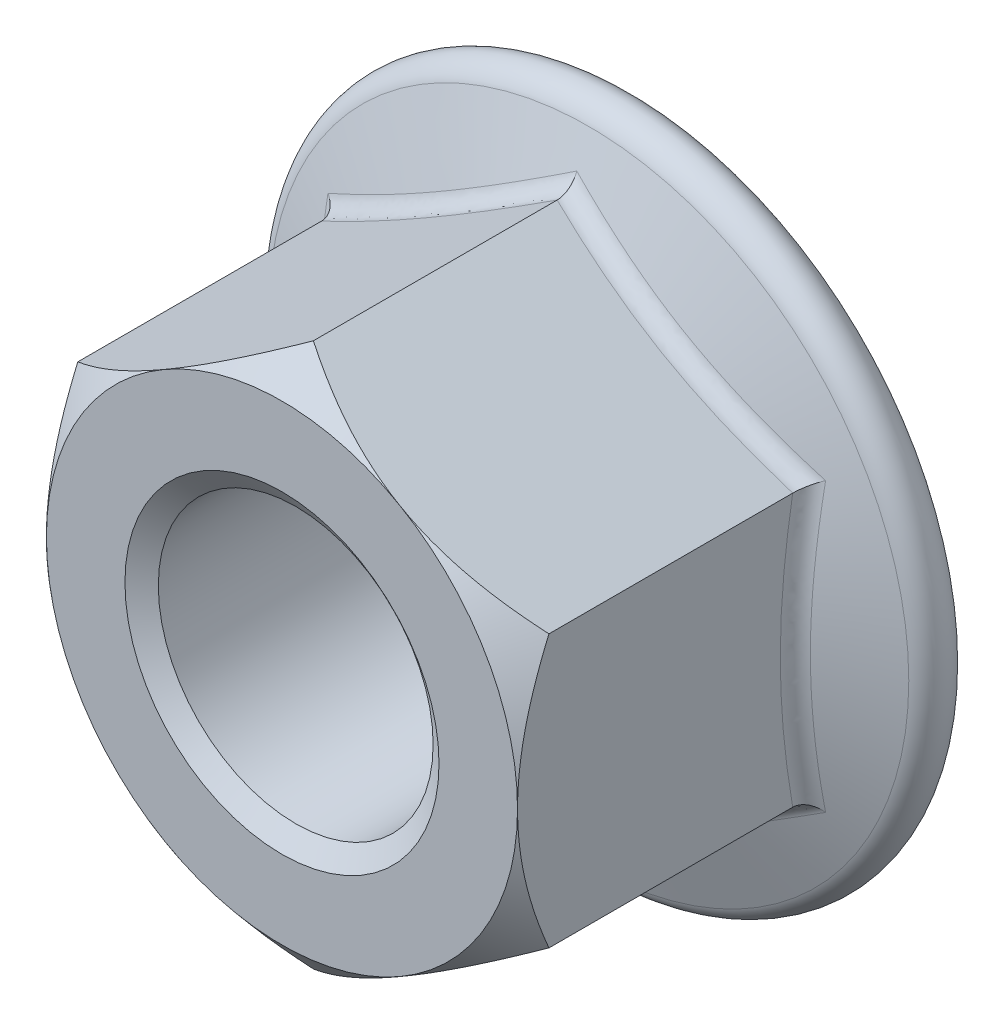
from build123d import *

# Parameters (mm, degrees)
BASENUTSKE_R   = 8.75
BASENUT_DEPTH  = 22.5298
FLANGEFILLET_R = 1.2


with BuildPart() as part:
    # BaseNutSke → BaseNut (new body)
    with BuildSketch(Plane.XY):
        Polygon((15, 8.660254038), (15, -8.660254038), (0, -17.320508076), (-15, -8.660254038), (-15, 8.660254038), (0, 17.320508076), align=None)
        Circle(BASENUTSKE_R, mode=Mode.SUBTRACT)
    extrude(amount=-BASENUT_DEPTH)

    # Sketch6 → Flange (revolve)
    with BuildSketch(Plane(origin=(0, 0, 0), x_dir=(0, 0, -1), z_dir=(1, 0, 0)), mode=Mode.PRIVATE) as flange_sk:
        with BuildLine():
            Line((15.29597298, 8.75), (19.5298, 20.382344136))
            ThreePointArc((19.5298, 20.382344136), (21.251733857, 21.376503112), (22.5298, 19.853363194))
            Line((22.5298, 19.853363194), (22.5298, 8.75))
            Line((22.5298, 8.75), (15.29597298, 8.75))
        make_face()
    revolve(flange_sk.sketch.rotate(Axis((0, 0, 0), (0, 0, -1)), 90), axis=Axis((0, 0, 0), (0, 0, -1)))

    # Sketch3 → Double-Chamfer (revolve, cut)
    with BuildSketch(Plane(origin=(0, 0, 0), x_dir=(0, 0, -1), z_dir=(1, 0, 0)), mode=Mode.PRIVATE) as double_chamfer_sk:
        Polygon((2, 30.020508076), (-12.7, 30.020508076), (-12.7, 15), (0, 15), (2, 17.320508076), align=None)
    revolve(double_chamfer_sk.sketch.rotate(Axis((0, 0, 0), (0, 0, -1)), 239.999999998), axis=Axis((0, 0, 0), (0, 0, -1)), mode=Mode.SUBTRACT)

    # FlangeFillet
    flangefillet_edges = [part.edges().sort_by_distance(p)[0] for p in [
        (15, -4.349016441, -17.795627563),
        (15, 4.349016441, -17.795627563),
        (-7.5, 12.990381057, -17.570786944),
        (-15, 0, -17.570786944),
        (-7.5, -12.990381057, -17.570786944),
        (7.5, 12.990381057, -17.570786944),
        (7.5, -12.990381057, -17.570786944),
    ]]
    fillet(flangefillet_edges, radius=FLANGEFILLET_R)

    # Sketch5 → EndChamfer (revolve, cut)
    with BuildSketch(Plane(origin=(0, 0, 0), x_dir=(0, 0, -1), z_dir=(1, 0, 0)), mode=Mode.PRIVATE) as endchamfer_sk:
        Polygon((22.5044, 10), (21.541614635, 8.625), (22.5552, 8.625), (22.5552, 10), align=None)
        Polygon((-0.0508, 10), (0, 10), (0.962785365, 8.625), (-0.0508, 8.625), align=None)
    revolve(endchamfer_sk.sketch.rotate(Axis((0, 0, -25.037505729), (0, 0, -1)), 90), axis=Axis((0, 0, -25.037505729), (0, 0, -1)), mode=Mode.SUBTRACT)


solid = part.part
